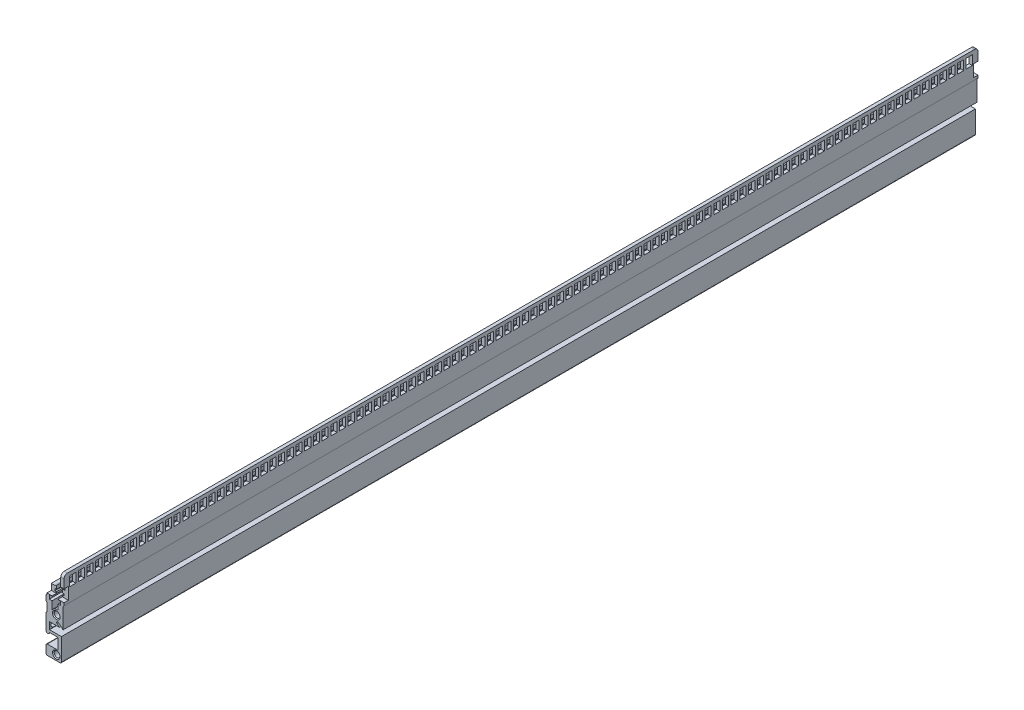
from build123d import *

# Parameters (mm, degrees)
SKETCH_1_R          = 1.7
EXTRUDE_1_DEPTH     = 533.4
FILLET_1_R          = 2
SKETCH_2_W          = 3.6
SKETCH_2_H          = 5.5
CUT_EXTRUDE_1_DEPTH = 1.9
SKETCH_3_W          = 2.54
SKETCH_3_H          = 7
CUT_EXTRUDE_2_DEPTH = 534.998885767
SKETCH_4_R          = 1.65
CUT_EXTRUDE_3_DEPTH = 2
CHAMFER_1_SIZE      = 0.5
CHAMFER_2_SIZE      = 0.5


with BuildPart() as part:
    # Sketch 1 → Extrude 1 (new body)
    with BuildSketch(Plane.XY):
        with BuildLine():
            Line((2.6, 12.5), (2.6, 22.5))
            Line((2.6, 22.5), (4.5, 22.5))
            Line((4.5, 22.5), (4.5, 6.95))
            Line((4.5, 6.95), (4, 6.45))
            Line((4, 6.45), (4, -5.445811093))
            Line((4, -5.445811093), (1.222426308, -3.115150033))
            ThreePointArc((1.222426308, -3.115150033), (0.377127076, -3.189104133), (0.451081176, -4.034403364))
            Line((0.451081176, -4.034403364), (1.899772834, -5.25))
            Line((1.899772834, -5.25), (-4, -5.25))
            Line((-4, -5.25), (-4, -9.35))
            Line((-4, -9.35), (3, -9.35))
            Line((3, -9.35), (3, -22.2))
            ThreePointArc((3, -22.2), (2.765685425, -22.765685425), (2.2, -23))
            Line((2.2, -23), (-5.2, -23))
            ThreePointArc((-5.2, -23), (-5.765685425, -22.765685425), (-6, -22.2))
            Line((-6, -22.2), (-6, -18.05))
            ThreePointArc((-6, -18.05), (-5.765685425, -17.484314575), (-5.2, -17.25))
            Line((-5.2, -17.25), (1, -17.25))
            Line((1, -17.25), (1, -10.75))
            Line((1, -10.75), (-4, -10.75))
            ThreePointArc((-4, -10.75), (-5, -11.75), (-6, -10.75))
            Line((-6, -10.75), (-6, -1.6))
            Line((-6, -1.6), (-5.550132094, -1.100195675))
            Line((-5.550132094, -1.100195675), (-5.549867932, 3.899804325))
            Line((-5.549867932, 3.899804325), (-6, 4.4))
            Line((-6, 4.4), (-6, 7.4))
            Line((-6, 7.4), (-5.7, 7.7))
            Line((-5.7, 7.7), (-5.45, 7.7))
            Line((-5.45, 7.7), (-5.45, 12.1))
            Line((-5.45, 12.1), (-3, 12.1))
            Line((-3, 12.1), (-3, 12.5))
            Line((-3, 12.5), (-2.45, 12.5))
            Line((-2.45, 12.5), (-2.45, 10.55))
            Line((-2.45, 10.55), (-3.35, 10.55))
            Line((-3.35, 10.55), (-3.35, 9.35))
            Line((-3.35, 9.35), (-2.45, 9.35))
            Line((-2.45, 9.35), (-2.45, 8.35))
            Line((-2.45, 8.35), (-4.05, 8.35))
            Line((-4.05, 8.35), (-4.05, 6.05))
            Line((-4.05, 6.05), (-2.45, 6.05))
            Line((-2.45, 6.05), (-2.45, 1.307669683))
            ThreePointArc((-2.45, 1.307669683), (-1.033604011, 2.711523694), (0.95, 2.917190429))
            Line((0.95, 2.917190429), (0.95, 6.05))
            Line((0.95, 6.05), (2.55, 6.05))
            Line((2.55, 6.05), (2.55, 8.35))
            Line((2.55, 8.35), (0.95, 8.35))
            Line((0.95, 8.35), (0.95, 9.35))
            Line((0.95, 9.35), (1.85, 9.35))
            Line((1.85, 9.35), (1.85, 10.55))
            Line((1.85, 10.55), (0.95, 10.55))
            Line((0.95, 10.55), (0.95, 12.5))
            Line((0.95, 12.5), (2.6, 12.5))
        make_face()
        Circle(SKETCH_1_R, mode=Mode.SUBTRACT)
        with Locations((0, -20)):
            Circle(SKETCH_1_R, mode=Mode.SUBTRACT)
    extrude(amount=-EXTRUDE_1_DEPTH)

    # Fillet 1
    fillet_1_edges = [part.edges().sort_by_distance(p)[0] for p in [
        (3.55, 22.5, -533.4),
        (3.55, 22.5, 0),
    ]]
    fillet(fillet_1_edges, radius=FILLET_1_R)

    # Sketch 2 → Cut-Extrude 1 (cut)
    with BuildSketch(Plane(origin=(4.5, 0, 0), x_dir=(0, 0, -1), z_dir=(1, 0, 0))):
        with Locations((10.16, 17.7)):
            Rectangle(SKETCH_2_W, SKETCH_2_H)
        with Locations((5.08, 17.7)):
            Rectangle(SKETCH_2_W, SKETCH_2_H)
        with Locations((15.24, 17.7)):
            Rectangle(SKETCH_2_W, SKETCH_2_H)
        with Locations((20.32, 17.7)):
            Rectangle(SKETCH_2_W, SKETCH_2_H)
        with Locations((25.4, 17.7)):
            Rectangle(SKETCH_2_W, SKETCH_2_H)
        with Locations((30.48, 17.7)):
            Rectangle(SKETCH_2_W, SKETCH_2_H)
        with Locations((35.56, 17.7)):
            Rectangle(SKETCH_2_W, SKETCH_2_H)
        with Locations((40.64, 17.7)):
            Rectangle(SKETCH_2_W, SKETCH_2_H)
        with Locations((45.72, 17.7)):
            Rectangle(SKETCH_2_W, SKETCH_2_H)
        with Locations((50.8, 17.7)):
            Rectangle(SKETCH_2_W, SKETCH_2_H)
        with Locations((55.88, 17.7)):
            Rectangle(SKETCH_2_W, SKETCH_2_H)
        with Locations((60.96, 17.7)):
            Rectangle(SKETCH_2_W, SKETCH_2_H)
        with Locations((66.04, 17.7)):
            Rectangle(SKETCH_2_W, SKETCH_2_H)
        with Locations((71.12, 17.7)):
            Rectangle(SKETCH_2_W, SKETCH_2_H)
        with Locations((76.2, 17.7)):
            Rectangle(SKETCH_2_W, SKETCH_2_H)
        with Locations((81.28, 17.7)):
            Rectangle(SKETCH_2_W, SKETCH_2_H)
        with Locations((86.36, 17.7)):
            Rectangle(SKETCH_2_W, SKETCH_2_H)
        with Locations((91.44, 17.7)):
            Rectangle(SKETCH_2_W, SKETCH_2_H)
        with Locations((96.52, 17.7)):
            Rectangle(SKETCH_2_W, SKETCH_2_H)
        with Locations((101.6, 17.7)):
            Rectangle(SKETCH_2_W, SKETCH_2_H)
        with Locations((106.68, 17.7)):
            Rectangle(SKETCH_2_W, SKETCH_2_H)
        with Locations((111.76, 17.7)):
            Rectangle(SKETCH_2_W, SKETCH_2_H)
        with Locations((116.84, 17.7)):
            Rectangle(SKETCH_2_W, SKETCH_2_H)
        with Locations((121.92, 17.7)):
            Rectangle(SKETCH_2_W, SKETCH_2_H)
        with Locations((127, 17.7)):
            Rectangle(SKETCH_2_W, SKETCH_2_H)
        with Locations((132.08, 17.7)):
            Rectangle(SKETCH_2_W, SKETCH_2_H)
        with Locations((137.16, 17.7)):
            Rectangle(SKETCH_2_W, SKETCH_2_H)
        with Locations((142.24, 17.7)):
            Rectangle(SKETCH_2_W, SKETCH_2_H)
        with Locations((147.32, 17.7)):
            Rectangle(SKETCH_2_W, SKETCH_2_H)
        with Locations((152.4, 17.7)):
            Rectangle(SKETCH_2_W, SKETCH_2_H)
        with Locations((157.48, 17.7)):
            Rectangle(SKETCH_2_W, SKETCH_2_H)
        with Locations((162.56, 17.7)):
            Rectangle(SKETCH_2_W, SKETCH_2_H)
        with Locations((167.64, 17.7)):
            Rectangle(SKETCH_2_W, SKETCH_2_H)
        with Locations((172.72, 17.7)):
            Rectangle(SKETCH_2_W, SKETCH_2_H)
        with Locations((177.8, 17.7)):
            Rectangle(SKETCH_2_W, SKETCH_2_H)
        with Locations((182.88, 17.7)):
            Rectangle(SKETCH_2_W, SKETCH_2_H)
        with Locations((187.96, 17.7)):
            Rectangle(SKETCH_2_W, SKETCH_2_H)
        with Locations((193.04, 17.7)):
            Rectangle(SKETCH_2_W, SKETCH_2_H)
        with Locations((198.12, 17.7)):
            Rectangle(SKETCH_2_W, SKETCH_2_H)
        with Locations((203.2, 17.7)):
            Rectangle(SKETCH_2_W, SKETCH_2_H)
        with Locations((208.28, 17.7)):
            Rectangle(SKETCH_2_W, SKETCH_2_H)
        with Locations((213.36, 17.7)):
            Rectangle(SKETCH_2_W, SKETCH_2_H)
        with Locations((218.44, 17.7)):
            Rectangle(SKETCH_2_W, SKETCH_2_H)
        with Locations((223.52, 17.7)):
            Rectangle(SKETCH_2_W, SKETCH_2_H)
        with Locations((228.6, 17.7)):
            Rectangle(SKETCH_2_W, SKETCH_2_H)
        with Locations((233.68, 17.7)):
            Rectangle(SKETCH_2_W, SKETCH_2_H)
        with Locations((238.76, 17.7)):
            Rectangle(SKETCH_2_W, SKETCH_2_H)
        with Locations((243.84, 17.7)):
            Rectangle(SKETCH_2_W, SKETCH_2_H)
        with Locations((248.92, 17.7)):
            Rectangle(SKETCH_2_W, SKETCH_2_H)
        with Locations((254, 17.7)):
            Rectangle(SKETCH_2_W, SKETCH_2_H)
        with Locations((259.08, 17.7)):
            Rectangle(SKETCH_2_W, SKETCH_2_H)
        with Locations((264.16, 17.7)):
            Rectangle(SKETCH_2_W, SKETCH_2_H)
        with Locations((269.24, 17.7)):
            Rectangle(SKETCH_2_W, SKETCH_2_H)
        with Locations((274.32, 17.7)):
            Rectangle(SKETCH_2_W, SKETCH_2_H)
        with Locations((279.4, 17.7)):
            Rectangle(SKETCH_2_W, SKETCH_2_H)
        with Locations((284.48, 17.7)):
            Rectangle(SKETCH_2_W, SKETCH_2_H)
        with Locations((289.56, 17.7)):
            Rectangle(SKETCH_2_W, SKETCH_2_H)
        with Locations((294.64, 17.7)):
            Rectangle(SKETCH_2_W, SKETCH_2_H)
        with Locations((299.72, 17.7)):
            Rectangle(SKETCH_2_W, SKETCH_2_H)
        with Locations((304.8, 17.7)):
            Rectangle(SKETCH_2_W, SKETCH_2_H)
        with Locations((309.88, 17.7)):
            Rectangle(SKETCH_2_W, SKETCH_2_H)
        with Locations((314.96, 17.7)):
            Rectangle(SKETCH_2_W, SKETCH_2_H)
        with Locations((320.04, 17.7)):
            Rectangle(SKETCH_2_W, SKETCH_2_H)
        with Locations((325.12, 17.7)):
            Rectangle(SKETCH_2_W, SKETCH_2_H)
        with Locations((330.2, 17.7)):
            Rectangle(SKETCH_2_W, SKETCH_2_H)
        with Locations((335.28, 17.7)):
            Rectangle(SKETCH_2_W, SKETCH_2_H)
        with Locations((340.36, 17.7)):
            Rectangle(SKETCH_2_W, SKETCH_2_H)
        with Locations((345.44, 17.7)):
            Rectangle(SKETCH_2_W, SKETCH_2_H)
        with Locations((350.52, 17.7)):
            Rectangle(SKETCH_2_W, SKETCH_2_H)
        with Locations((355.6, 17.7)):
            Rectangle(SKETCH_2_W, SKETCH_2_H)
        with Locations((360.68, 17.7)):
            Rectangle(SKETCH_2_W, SKETCH_2_H)
        with Locations((365.76, 17.7)):
            Rectangle(SKETCH_2_W, SKETCH_2_H)
        with Locations((370.84, 17.7)):
            Rectangle(SKETCH_2_W, SKETCH_2_H)
        with Locations((375.92, 17.7)):
            Rectangle(SKETCH_2_W, SKETCH_2_H)
        with Locations((381, 17.7)):
            Rectangle(SKETCH_2_W, SKETCH_2_H)
        with Locations((386.08, 17.7)):
            Rectangle(SKETCH_2_W, SKETCH_2_H)
        with Locations((391.16, 17.7)):
            Rectangle(SKETCH_2_W, SKETCH_2_H)
        with Locations((396.24, 17.7)):
            Rectangle(SKETCH_2_W, SKETCH_2_H)
        with Locations((401.32, 17.7)):
            Rectangle(SKETCH_2_W, SKETCH_2_H)
        with Locations((406.4, 17.7)):
            Rectangle(SKETCH_2_W, SKETCH_2_H)
        with Locations((411.48, 17.7)):
            Rectangle(SKETCH_2_W, SKETCH_2_H)
        with Locations((416.56, 17.7)):
            Rectangle(SKETCH_2_W, SKETCH_2_H)
        with Locations((421.64, 17.7)):
            Rectangle(SKETCH_2_W, SKETCH_2_H)
        with Locations((426.72, 17.7)):
            Rectangle(SKETCH_2_W, SKETCH_2_H)
        with Locations((431.8, 17.7)):
            Rectangle(SKETCH_2_W, SKETCH_2_H)
        with Locations((436.88, 17.7)):
            Rectangle(SKETCH_2_W, SKETCH_2_H)
        with Locations((441.96, 17.7)):
            Rectangle(SKETCH_2_W, SKETCH_2_H)
        with Locations((447.04, 17.7)):
            Rectangle(SKETCH_2_W, SKETCH_2_H)
        with Locations((452.12, 17.7)):
            Rectangle(SKETCH_2_W, SKETCH_2_H)
        with Locations((457.2, 17.7)):
            Rectangle(SKETCH_2_W, SKETCH_2_H)
        with Locations((462.28, 17.7)):
            Rectangle(SKETCH_2_W, SKETCH_2_H)
        with Locations((467.36, 17.7)):
            Rectangle(SKETCH_2_W, SKETCH_2_H)
        with Locations((472.44, 17.7)):
            Rectangle(SKETCH_2_W, SKETCH_2_H)
        with Locations((477.52, 17.7)):
            Rectangle(SKETCH_2_W, SKETCH_2_H)
        with Locations((482.6, 17.7)):
            Rectangle(SKETCH_2_W, SKETCH_2_H)
        with Locations((487.68, 17.7)):
            Rectangle(SKETCH_2_W, SKETCH_2_H)
        with Locations((492.76, 17.7)):
            Rectangle(SKETCH_2_W, SKETCH_2_H)
        with Locations((497.84, 17.7)):
            Rectangle(SKETCH_2_W, SKETCH_2_H)
        with Locations((502.92, 17.7)):
            Rectangle(SKETCH_2_W, SKETCH_2_H)
        with Locations((508, 17.7)):
            Rectangle(SKETCH_2_W, SKETCH_2_H)
        with Locations((513.08, 17.7)):
            Rectangle(SKETCH_2_W, SKETCH_2_H)
        with Locations((518.16, 17.7)):
            Rectangle(SKETCH_2_W, SKETCH_2_H)
        with Locations((523.24, 17.7)):
            Rectangle(SKETCH_2_W, SKETCH_2_H)
        with Locations((528.32, 17.7)):
            Rectangle(SKETCH_2_W, SKETCH_2_H)
    extrude(amount=-CUT_EXTRUDE_1_DEPTH, mode=Mode.SUBTRACT)

    # Sketch 3 → Cut-Extrude 2 (cut, through all)
    with BuildSketch(Plane(origin=(4.5, 0, 0), x_dir=(0, 0, -1), z_dir=(1, 0, 0))):
        with Locations((1.27, 12)):
            Rectangle(SKETCH_3_W, SKETCH_3_H)
    cut_extrude_2 = extrude(amount=-CUT_EXTRUDE_2_DEPTH, mode=Mode.SUBTRACT)

    # Mirror 1: Cut-Extrude 2 across plane
    add(cut_extrude_2.mirror(Plane.XY.offset(-266.7)), mode=Mode.SUBTRACT)

    # Sketch 4 → Cut-Extrude 3 (cut)
    with BuildSketch(Plane.ZY.offset(6)):
        with Locations((-530.86, -7.45)):
            Circle(SKETCH_4_R)
        with Locations((-525.78, -7.45)):
            Circle(SKETCH_4_R)
        with Locations((-520.7, -7.45)):
            Circle(SKETCH_4_R)
        with Locations((-515.62, -7.45)):
            Circle(SKETCH_4_R)
        with Locations((-510.54, -7.45)):
            Circle(SKETCH_4_R)
        with Locations((-505.46, -7.45)):
            Circle(SKETCH_4_R)
        with Locations((-500.38, -7.45)):
            Circle(SKETCH_4_R)
        with Locations((-495.3, -7.45)):
            Circle(SKETCH_4_R)
        with Locations((-490.22, -7.45)):
            Circle(SKETCH_4_R)
        with Locations((-485.14, -7.45)):
            Circle(SKETCH_4_R)
        with Locations((-480.06, -7.45)):
            Circle(SKETCH_4_R)
        with Locations((-474.98, -7.45)):
            Circle(SKETCH_4_R)
        with Locations((-469.9, -7.45)):
            Circle(SKETCH_4_R)
        with Locations((-464.82, -7.45)):
            Circle(SKETCH_4_R)
        with Locations((-459.74, -7.45)):
            Circle(SKETCH_4_R)
        with Locations((-454.66, -7.45)):
            Circle(SKETCH_4_R)
        with Locations((-449.58, -7.45)):
            Circle(SKETCH_4_R)
        with Locations((-444.5, -7.45)):
            Circle(SKETCH_4_R)
        with Locations((-439.42, -7.45)):
            Circle(SKETCH_4_R)
        with Locations((-434.34, -7.45)):
            Circle(SKETCH_4_R)
        with Locations((-429.26, -7.45)):
            Circle(SKETCH_4_R)
        with Locations((-424.18, -7.45)):
            Circle(SKETCH_4_R)
        with Locations((-419.1, -7.45)):
            Circle(SKETCH_4_R)
        with Locations((-414.02, -7.45)):
            Circle(SKETCH_4_R)
        with Locations((-408.94, -7.45)):
            Circle(SKETCH_4_R)
        with Locations((-403.86, -7.45)):
            Circle(SKETCH_4_R)
        with Locations((-398.78, -7.45)):
            Circle(SKETCH_4_R)
        with Locations((-393.7, -7.45)):
            Circle(SKETCH_4_R)
        with Locations((-388.62, -7.45)):
            Circle(SKETCH_4_R)
        with Locations((-383.54, -7.45)):
            Circle(SKETCH_4_R)
        with Locations((-378.46, -7.45)):
            Circle(SKETCH_4_R)
        with Locations((-373.38, -7.45)):
            Circle(SKETCH_4_R)
        with Locations((-368.3, -7.45)):
            Circle(SKETCH_4_R)
        with Locations((-363.22, -7.45)):
            Circle(SKETCH_4_R)
        with Locations((-358.14, -7.45)):
            Circle(SKETCH_4_R)
        with Locations((-353.06, -7.45)):
            Circle(SKETCH_4_R)
        with Locations((-347.98, -7.45)):
            Circle(SKETCH_4_R)
        with Locations((-342.9, -7.45)):
            Circle(SKETCH_4_R)
        with Locations((-337.82, -7.45)):
            Circle(SKETCH_4_R)
        with Locations((-332.74, -7.45)):
            Circle(SKETCH_4_R)
        with Locations((-327.66, -7.45)):
            Circle(SKETCH_4_R)
        with Locations((-322.58, -7.45)):
            Circle(SKETCH_4_R)
        with Locations((-317.5, -7.45)):
            Circle(SKETCH_4_R)
        with Locations((-312.42, -7.45)):
            Circle(SKETCH_4_R)
        with Locations((-307.34, -7.45)):
            Circle(SKETCH_4_R)
        with Locations((-302.26, -7.45)):
            Circle(SKETCH_4_R)
        with Locations((-297.18, -7.45)):
            Circle(SKETCH_4_R)
        with Locations((-292.1, -7.45)):
            Circle(SKETCH_4_R)
        with Locations((-287.02, -7.45)):
            Circle(SKETCH_4_R)
        with Locations((-281.94, -7.45)):
            Circle(SKETCH_4_R)
        with Locations((-276.86, -7.45)):
            Circle(SKETCH_4_R)
        with Locations((-271.78, -7.45)):
            Circle(SKETCH_4_R)
        with Locations((-266.7, -7.45)):
            Circle(SKETCH_4_R)
        with Locations((-261.62, -7.45)):
            Circle(SKETCH_4_R)
        with Locations((-256.54, -7.45)):
            Circle(SKETCH_4_R)
        with Locations((-251.46, -7.45)):
            Circle(SKETCH_4_R)
        with Locations((-246.38, -7.45)):
            Circle(SKETCH_4_R)
        with Locations((-241.3, -7.45)):
            Circle(SKETCH_4_R)
        with Locations((-236.22, -7.45)):
            Circle(SKETCH_4_R)
        with Locations((-231.14, -7.45)):
            Circle(SKETCH_4_R)
        with Locations((-226.06, -7.45)):
            Circle(SKETCH_4_R)
        with Locations((-220.98, -7.45)):
            Circle(SKETCH_4_R)
        with Locations((-215.9, -7.45)):
            Circle(SKETCH_4_R)
        with Locations((-210.82, -7.45)):
            Circle(SKETCH_4_R)
        with Locations((-205.74, -7.45)):
            Circle(SKETCH_4_R)
        with Locations((-200.66, -7.45)):
            Circle(SKETCH_4_R)
        with Locations((-195.58, -7.45)):
            Circle(SKETCH_4_R)
        with Locations((-190.5, -7.45)):
            Circle(SKETCH_4_R)
        with Locations((-185.42, -7.45)):
            Circle(SKETCH_4_R)
        with Locations((-180.34, -7.45)):
            Circle(SKETCH_4_R)
        with Locations((-175.26, -7.45)):
            Circle(SKETCH_4_R)
        with Locations((-170.18, -7.45)):
            Circle(SKETCH_4_R)
        with Locations((-165.1, -7.45)):
            Circle(SKETCH_4_R)
        with Locations((-160.02, -7.45)):
            Circle(SKETCH_4_R)
        with Locations((-154.94, -7.45)):
            Circle(SKETCH_4_R)
        with Locations((-149.86, -7.45)):
            Circle(SKETCH_4_R)
        with Locations((-144.78, -7.45)):
            Circle(SKETCH_4_R)
        with Locations((-139.7, -7.45)):
            Circle(SKETCH_4_R)
        with Locations((-134.62, -7.45)):
            Circle(SKETCH_4_R)
        with Locations((-129.54, -7.45)):
            Circle(SKETCH_4_R)
        with Locations((-124.46, -7.45)):
            Circle(SKETCH_4_R)
        with Locations((-119.38, -7.45)):
            Circle(SKETCH_4_R)
        with Locations((-114.3, -7.45)):
            Circle(SKETCH_4_R)
        with Locations((-109.22, -7.45)):
            Circle(SKETCH_4_R)
        with Locations((-104.14, -7.45)):
            Circle(SKETCH_4_R)
        with Locations((-99.06, -7.45)):
            Circle(SKETCH_4_R)
        with Locations((-93.98, -7.45)):
            Circle(SKETCH_4_R)
        with Locations((-88.9, -7.45)):
            Circle(SKETCH_4_R)
        with Locations((-83.82, -7.45)):
            Circle(SKETCH_4_R)
        with Locations((-78.74, -7.45)):
            Circle(SKETCH_4_R)
        with Locations((-73.66, -7.45)):
            Circle(SKETCH_4_R)
        with Locations((-68.58, -7.45)):
            Circle(SKETCH_4_R)
        with Locations((-63.5, -7.45)):
            Circle(SKETCH_4_R)
        with Locations((-58.42, -7.45)):
            Circle(SKETCH_4_R)
        with Locations((-53.34, -7.45)):
            Circle(SKETCH_4_R)
        with Locations((-48.26, -7.45)):
            Circle(SKETCH_4_R)
        with Locations((-43.18, -7.45)):
            Circle(SKETCH_4_R)
        with Locations((-38.1, -7.45)):
            Circle(SKETCH_4_R)
        with Locations((-33.02, -7.45)):
            Circle(SKETCH_4_R)
        with Locations((-27.94, -7.45)):
            Circle(SKETCH_4_R)
        with Locations((-22.86, -7.45)):
            Circle(SKETCH_4_R)
        with Locations((-17.78, -7.45)):
            Circle(SKETCH_4_R)
        with Locations((-12.7, -7.45)):
            Circle(SKETCH_4_R)
        with Locations((-7.62, -7.45)):
            Circle(SKETCH_4_R)
        with Locations((-2.54, -7.45)):
            Circle(SKETCH_4_R)
    extrude(amount=-CUT_EXTRUDE_3_DEPTH, mode=Mode.SUBTRACT)

    # Chamfer 1
    chamfer_1_edges = [part.edges().sort_by_distance(p)[0] for p in [
        (-1.7, 0, -533.4),
        (-1.7, 0, 0),
        (-1.7, -20, 0),
    ]]
    chamfer(chamfer_1_edges, length=CHAMFER_1_SIZE)

    # Chamfer 2
    chamfer_2_edges = [part.edges().sort_by_distance(p)[0] for p in [
        (-1.7, -20, -533.4),
    ]]
    chamfer(chamfer_2_edges, length=CHAMFER_2_SIZE)


solid = part.part
